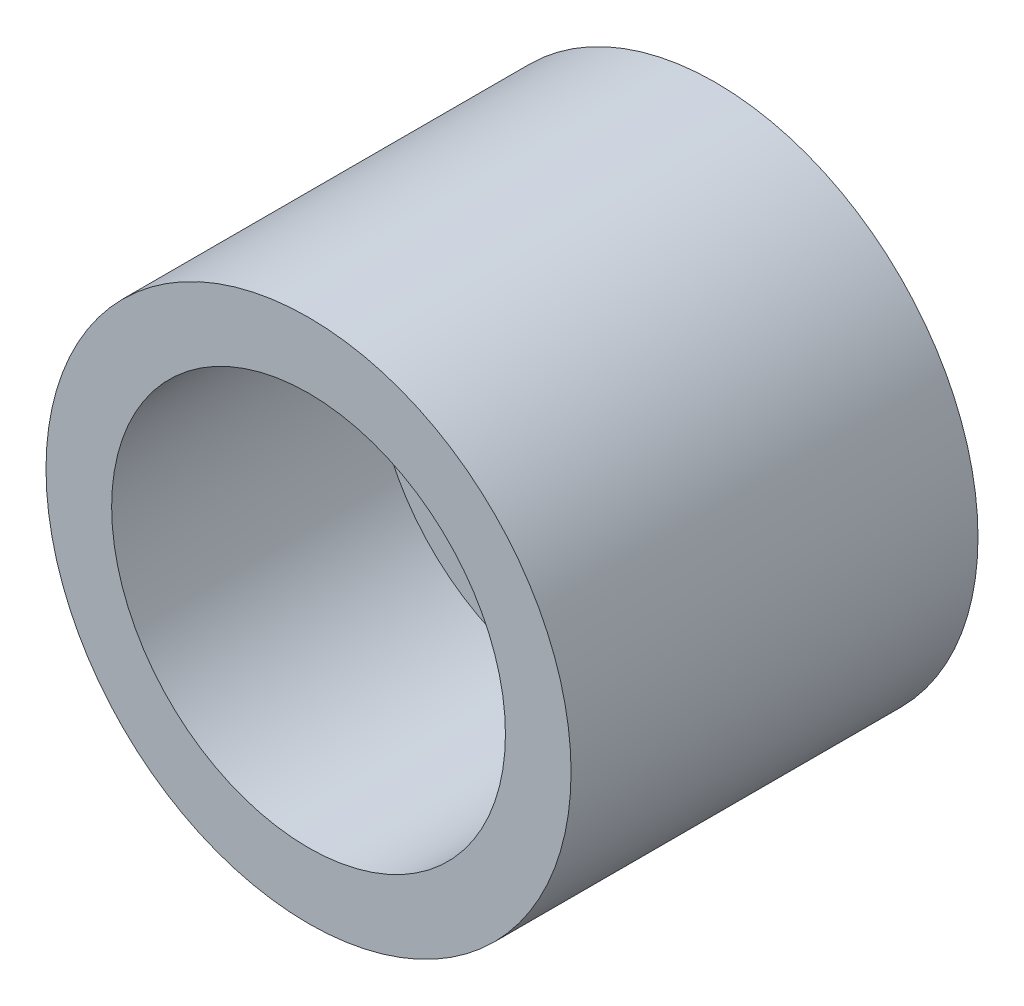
from build123d import *

# Parameters (mm, degrees)
ESQUISSE2_R                                        = 10
EXTRUSION2_DEPTH                                   = 15.5
CHAMBRAGE_POUR_VIS_T_TE_HEXAGONALE_M81_D           = 9
CHAMBRAGE_POUR_VIS_T_TE_HEXAGONALE_M81_CBORE_D     = 15
CHAMBRAGE_POUR_VIS_T_TE_HEXAGONALE_M81_CBORE_DEPTH = 10


with BuildPart() as part:
    # Esquisse2 → Extrusion2 (new body)
    with BuildSketch(Plane.XY):
        Circle(ESQUISSE2_R)
    extrude(amount=EXTRUSION2_DEPTH)

    # Chambrage pour vis _ t_te hexagonale M81 (through all)
    with Locations(Plane.XY.offset(15.5)):
        with Locations((0, 0)):
            CounterBoreHole(CHAMBRAGE_POUR_VIS_T_TE_HEXAGONALE_M81_D / 2, CHAMBRAGE_POUR_VIS_T_TE_HEXAGONALE_M81_CBORE_D / 2, CHAMBRAGE_POUR_VIS_T_TE_HEXAGONALE_M81_CBORE_DEPTH)


solid = part.part
